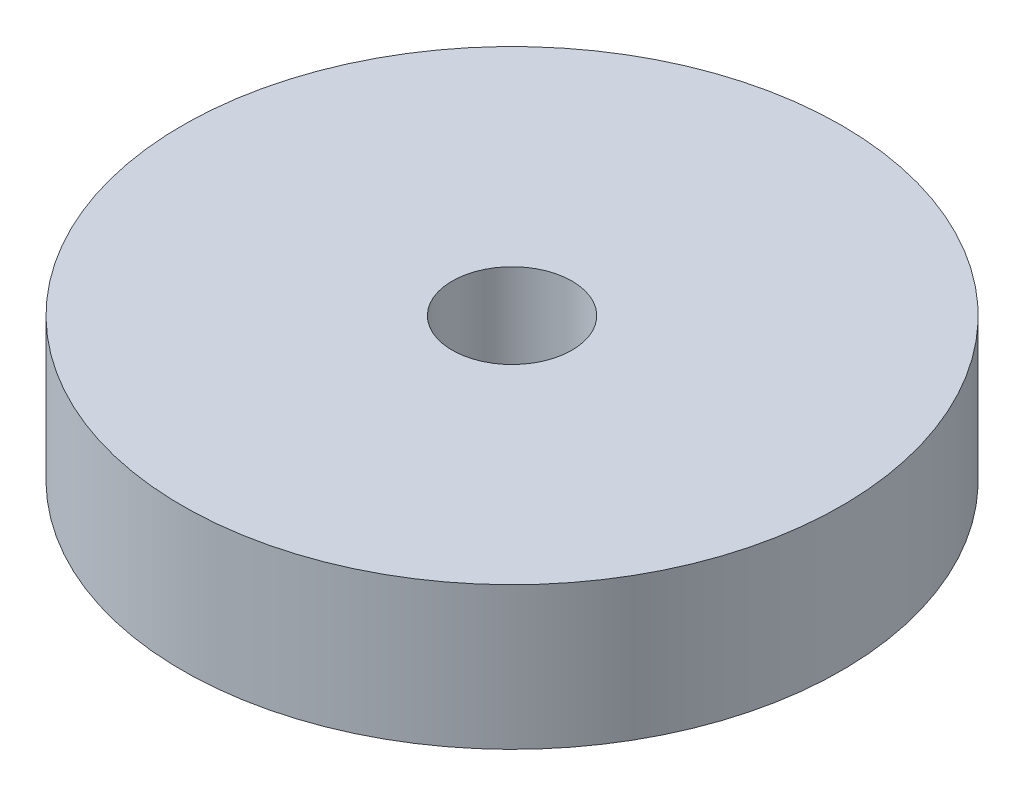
from build123d import *

# Parameters (mm, degrees)
SKETCH1_W = 6.0452
SKETCH1_H = 11.43


with BuildPart() as part:
    # Sketch1 → Base-Revolve (revolve)
    with BuildSketch(Plane(origin=(0, 0, 0), x_dir=(0, 1, 0), z_dir=(-1, 0, 0))):
        with Locations((-3.0226, 8.255)):
            Rectangle(SKETCH1_W, SKETCH1_H)
    revolve(axis=Axis((0, -3.175, 0), (0, 1, 0)))


solid = part.part
